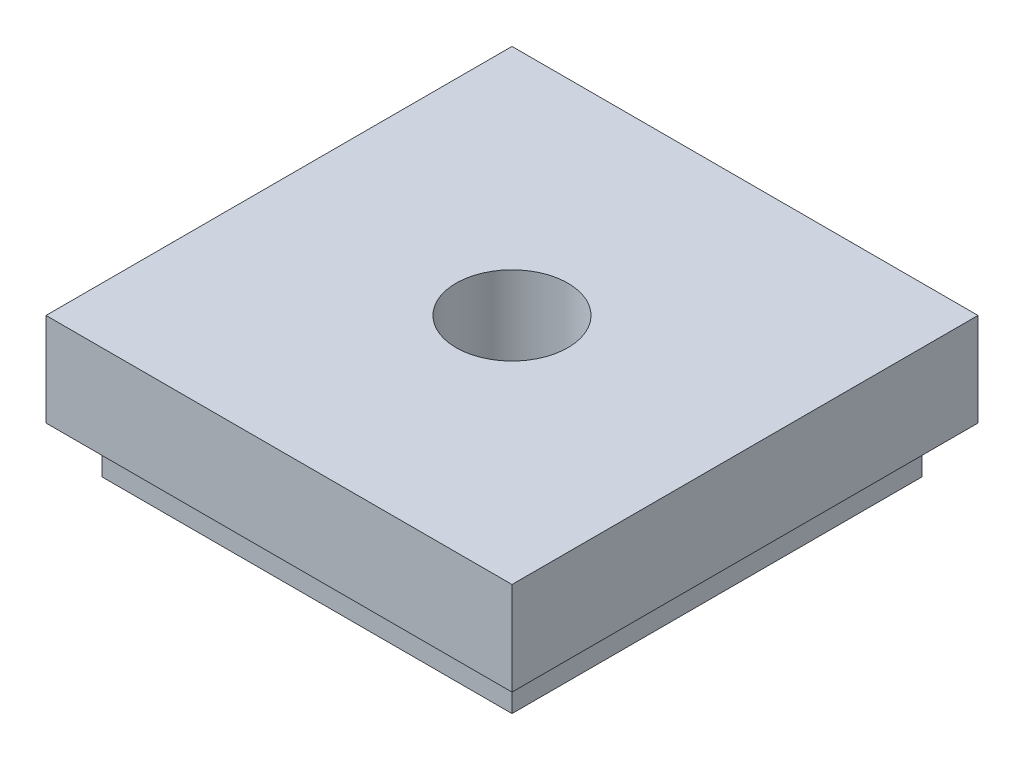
from build123d import *

# Parameters (mm, degrees)
ESQUISSE1_W      = 50
ESQUISSE1_H      = 50
EXTRUSION1_DEPTH = 10
ESQUISSE2_W      = 44
ESQUISSE2_H      = 44
ESQUISSE2_W_2    = 40
ESQUISSE2_H_2    = 40
EXTRUSION2_DEPTH = 5
ESQUISSE4_R      = 6
EXTRUSION3_DEPTH = 10


with BuildPart() as part:
    # Esquisse1 → Extrusion1 (new body)
    with BuildSketch(Plane(origin=(0, 0, 0), x_dir=(1, 0, 0), z_dir=(0, 1, 0))):
        with Locations((25, 25)):
            Rectangle(ESQUISSE1_W, ESQUISSE1_H)
    extrude(amount=EXTRUSION1_DEPTH)

    # Esquisse2 → Extrusion2 (add)
    with BuildSketch(Plane.XZ):
        with Locations((25, -25)):
            Rectangle(ESQUISSE2_W, ESQUISSE2_H)
        with Locations((25, -25)):
            Rectangle(ESQUISSE2_W_2, ESQUISSE2_H_2, mode=Mode.SUBTRACT)
    extrude(amount=EXTRUSION2_DEPTH)

    # Esquisse4 → Extrusion3 (cut)
    with BuildSketch(Plane(origin=(0, 10, 0), x_dir=(-1, 0, 0), z_dir=(0, 1, 0))):
        with Locations(Location((-25, -25, 0), (0, 0, 90))):
            Circle(ESQUISSE4_R)
    extrude(amount=-EXTRUSION3_DEPTH, mode=Mode.SUBTRACT)


solid = part.part
